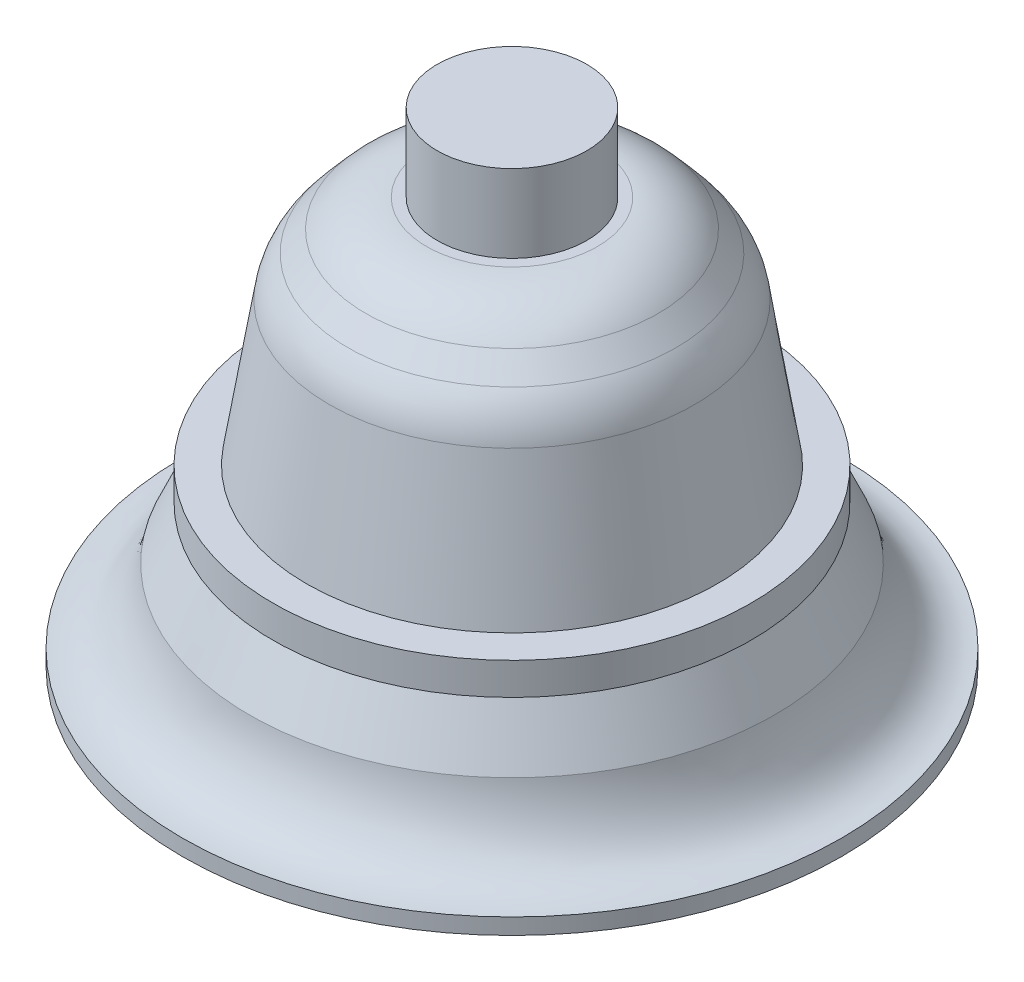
ISO-10303-21;
HEADER;
FILE_DESCRIPTION(('STEP AP214'),'2;1');
FILE_NAME('part.step','',(''),(''),'','','');
FILE_SCHEMA(('AUTOMOTIVE_DESIGN { 1 0 10303 214 1 1 1 1 }'));
ENDSEC;
DATA;
#1=APPLICATION_CONTEXT('core data for automotive mechanical design processes');
#2=APPLICATION_PROTOCOL_DEFINITION('international standard','automotive_design',2000,#1);
#3=PRODUCT_CONTEXT('',#1,'mechanical');
#4=PRODUCT('Part','Part','',(#3));
#5=PRODUCT_RELATED_PRODUCT_CATEGORY('part','',(#4));
#6=PRODUCT_DEFINITION_FORMATION('','',#4);
#7=PRODUCT_DEFINITION_CONTEXT('part definition',#1,'design');
#8=PRODUCT_DEFINITION('design','',#6,#7);
#9=PRODUCT_DEFINITION_SHAPE('','',#8);
#10=(LENGTH_UNIT() NAMED_UNIT(*) SI_UNIT(.MILLI.,.METRE.));
#11=(NAMED_UNIT(*) PLANE_ANGLE_UNIT() SI_UNIT($,.RADIAN.));
#12=(NAMED_UNIT(*) SI_UNIT($,.STERADIAN.) SOLID_ANGLE_UNIT());
#13=UNCERTAINTY_MEASURE_WITH_UNIT(LENGTH_MEASURE(1.E-05),#10,'distance_accuracy_value','');
#14=(GEOMETRIC_REPRESENTATION_CONTEXT(3) GLOBAL_UNCERTAINTY_ASSIGNED_CONTEXT((#13)) GLOBAL_UNIT_ASSIGNED_CONTEXT((#10,
#11,#12)) REPRESENTATION_CONTEXT('',''));
#15=CARTESIAN_POINT('',(0.,0.,0.));
#16=DIRECTION('',(0.,0.,1.));
#17=DIRECTION('',(1.,0.,0.));
#18=AXIS2_PLACEMENT_3D('',#15,#16,#17);
#19=CARTESIAN_POINT('',(0.,10.5147102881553,-30.733664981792));
#20=CARTESIAN_POINT('',(0.,9.09646290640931,-30.9523627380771));
#21=CARTESIAN_POINT('',(0.,6.25695318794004,-31.7179297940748));
#22=CARTESIAN_POINT('',(0.,3.24208382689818,-33.4625573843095));
#23=CARTESIAN_POINT('',(0.,1.44275660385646,-35.3297078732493));
#24=CARTESIAN_POINT('',(0.,0.443371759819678,-36.9732924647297));
#25=CARTESIAN_POINT('',(0.,-0.0644643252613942,-38.5409114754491));
#26=CARTESIAN_POINT('',(0.,-0.27110225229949,-39.9312003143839));
#27=CARTESIAN_POINT('',(0.,-0.30480306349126,-40.681149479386));
#28=CARTESIAN_POINT('',(0.,-0.30480306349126,-41.0498640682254));
#29=B_SPLINE_CURVE_WITH_KNOTS('',3,(#19,#20,#21,#22,#23,#24,#25,#26,#27,#28),.UNSPECIFIED.,.F.,
.F.,(4,1,1,1,1,1,1,4),(0.,0.25,0.5,0.625,0.75,0.875,0.9375,1.),.UNSPECIFIED.);
#30=CARTESIAN_POINT('',(0.,10.8195133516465,0.));
#31=DIRECTION('',(0.,-1.,0.));
#32=AXIS1_PLACEMENT('',#30,#31);
#33=SURFACE_OF_REVOLUTION('',#29,#32);
#34=CARTESIAN_POINT('',(0.,-0.30480306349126,0.));
#35=DIRECTION('',(0.,-1.,0.));
#36=DIRECTION('',(0.,0.,-1.));
#37=AXIS2_PLACEMENT_3D('',#34,#35,#36);
#38=CIRCLE('',#37,41.0498640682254);
#39=CARTESIAN_POINT('',(0.,-0.30480306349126,-41.0498640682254));
#40=VERTEX_POINT('',#39);
#41=EDGE_CURVE('E10',#40,#40,#38,.T.);
#42=ORIENTED_EDGE('',*,*,#41,.T.);
#43=EDGE_LOOP('',(#42));
#44=FACE_BOUND('',#43,.T.);
#45=CARTESIAN_POINT('',(0.,10.5147102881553,0.));
#46=DIRECTION('',(0.,-1.,0.));
#47=DIRECTION('',(0.,0.,-1.));
#48=AXIS2_PLACEMENT_3D('',#45,#46,#47);
#49=CIRCLE('',#48,30.733664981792);
#50=CARTESIAN_POINT('',(0.,10.5147102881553,-30.733664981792));
#51=VERTEX_POINT('',#50);
#52=EDGE_CURVE('E84',#51,#51,#49,.T.);
#53=ORIENTED_EDGE('',*,*,#52,.F.);
#54=EDGE_LOOP('',(#53));
#55=FACE_BOUND('',#54,.T.);
#56=ADVANCED_FACE('F36',(#44,#55),#33,.F.);
#57=CARTESIAN_POINT('',(0.,10.8195133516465,0.));
#58=DIRECTION('',(0.,-1.,0.));
#59=DIRECTION('',(0.,0.,-1.));
#60=AXIS2_PLACEMENT_3D('',#57,#58,#59);
#61=CYLINDRICAL_SURFACE('',#60,41.0498640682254);
#62=CARTESIAN_POINT('',(0.,1.69519693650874,0.));
#63=DIRECTION('',(0.,-1.,0.));
#64=DIRECTION('',(0.,0.,-1.));
#65=AXIS2_PLACEMENT_3D('',#62,#63,#64);
#66=CIRCLE('',#65,41.0498640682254);
#67=CARTESIAN_POINT('',(0.,1.69519693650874,-41.0498640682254));
#68=VERTEX_POINT('',#67);
#69=EDGE_CURVE('E44',#68,#68,#66,.T.);
#70=ORIENTED_EDGE('',*,*,#69,.T.);
#71=EDGE_LOOP('',(#70));
#72=FACE_BOUND('',#71,.T.);
#73=ORIENTED_EDGE('',*,*,#41,.F.);
#74=EDGE_LOOP('',(#73));
#75=FACE_BOUND('',#74,.T.);
#76=ADVANCED_FACE('F103',(#72,#75),#61,.T.);
#77=CARTESIAN_POINT('',(0.,1.69519693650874,-41.0498640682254));
#78=CARTESIAN_POINT('',(0.,1.69519693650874,-40.7438213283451));
#79=CARTESIAN_POINT('',(0.,1.72402123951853,-40.1122573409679));
#80=CARTESIAN_POINT('',(0.,1.88921846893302,-39.0127451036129));
#81=CARTESIAN_POINT('',(0.,2.28139088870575,-37.807256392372));
#82=CARTESIAN_POINT('',(0.,3.03360538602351,-36.5703123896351));
#83=CARTESIAN_POINT('',(0.,4.43959818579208,-35.10049370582));
#84=CARTESIAN_POINT('',(0.,6.89085856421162,-33.6587637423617));
#85=CARTESIAN_POINT('',(0.,9.35415681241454,-32.9608292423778));
#86=CARTESIAN_POINT('',(0.,10.616498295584,-32.7425017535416));
#87=CARTESIAN_POINT('',(0.,10.7431650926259,-32.7220754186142));
#88=CARTESIAN_POINT('',(0.,10.8195133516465,-32.7103023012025));
#89=B_SPLINE_CURVE_WITH_KNOTS('',3,(#77,#78,#79,#80,#81,#82,#83,#84,#85,#86,#87,#88),
.UNSPECIFIED.,.F.,.F.,(4,1,1,1,1,1,1,1,1,4),(0.,0.0625,0.125,0.25,0.375,0.5,0.75,
0.974804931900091,0.984882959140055,1.),.UNSPECIFIED.);
#90=CARTESIAN_POINT('',(0.,10.8195133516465,0.));
#91=DIRECTION('',(0.,-1.,0.));
#92=AXIS1_PLACEMENT('',#90,#91);
#93=SURFACE_OF_REVOLUTION('',#89,#92);
#94=CARTESIAN_POINT('',(0.,10.8195133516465,0.));
#95=DIRECTION('',(0.,-1.,0.));
#96=DIRECTION('',(0.,0.,-1.));
#97=AXIS2_PLACEMENT_3D('',#94,#95,#96);
#98=CIRCLE('',#97,32.7103023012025);
#99=CARTESIAN_POINT('',(0.,10.8195133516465,-32.7103023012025));
#100=VERTEX_POINT('',#99);
#101=EDGE_CURVE('E48',#100,#100,#98,.T.);
#102=ORIENTED_EDGE('',*,*,#101,.T.);
#103=EDGE_LOOP('',(#102));
#104=FACE_BOUND('',#103,.T.);
#105=ORIENTED_EDGE('',*,*,#69,.F.);
#106=EDGE_LOOP('',(#105));
#107=FACE_BOUND('',#106,.T.);
#108=ADVANCED_FACE('F99',(#104,#107),#93,.F.);
#109=CARTESIAN_POINT('',(0.,10.8195133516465,0.));
#110=DIRECTION('',(0.,-1.,0.));
#111=DIRECTION('',(0.,0.,-1.));
#112=AXIS2_PLACEMENT_3D('',#109,#110,#111);
#113=CONICAL_SURFACE('',#112,32.7103023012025,0.418914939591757);
#114=CARTESIAN_POINT('',(0.,17.4051870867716,0.));
#115=DIRECTION('',(0.,-1.,0.));
#116=DIRECTION('',(0.,0.,-1.));
#117=AXIS2_PLACEMENT_3D('',#114,#115,#116);
#118=CIRCLE('',#117,29.7778879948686);
#119=CARTESIAN_POINT('',(0.,17.4051870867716,-29.7778879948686));
#120=VERTEX_POINT('',#119);
#121=EDGE_CURVE('E52',#120,#120,#118,.T.);
#122=ORIENTED_EDGE('',*,*,#121,.T.);
#123=EDGE_LOOP('',(#122));
#124=FACE_BOUND('',#123,.T.);
#125=ORIENTED_EDGE('',*,*,#101,.F.);
#126=EDGE_LOOP('',(#125));
#127=FACE_BOUND('',#126,.T.);
#128=ADVANCED_FACE('F102',(#124,#127),#113,.T.);
#129=CARTESIAN_POINT('',(0.,10.8195133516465,0.));
#130=DIRECTION('',(0.,-1.,0.));
#131=DIRECTION('',(0.,0.,-1.));
#132=AXIS2_PLACEMENT_3D('',#129,#130,#131);
#133=CYLINDRICAL_SURFACE('',#132,29.7778879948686);
#134=CARTESIAN_POINT('',(0.,21.4107168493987,0.));
#135=DIRECTION('',(0.,-1.,0.));
#136=DIRECTION('',(0.,0.,-1.));
#137=AXIS2_PLACEMENT_3D('',#134,#135,#136);
#138=CIRCLE('',#137,29.7778879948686);
#139=CARTESIAN_POINT('',(0.,21.4107168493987,-29.7778879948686));
#140=VERTEX_POINT('',#139);
#141=EDGE_CURVE('E57',#140,#140,#138,.T.);
#142=ORIENTED_EDGE('',*,*,#141,.T.);
#143=EDGE_LOOP('',(#142));
#144=FACE_BOUND('',#143,.T.);
#145=ORIENTED_EDGE('',*,*,#121,.F.);
#146=EDGE_LOOP('',(#145));
#147=FACE_BOUND('',#146,.T.);
#148=ADVANCED_FACE('F162',(#144,#147),#133,.T.);
#149=CARTESIAN_POINT('',(0.,21.4107168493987,-29.7778879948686));
#150=DIRECTION('',(0.,1.,0.));
#151=DIRECTION('',(0.,0.,1.));
#152=AXIS2_PLACEMENT_3D('',#149,#150,#151);
#153=PLANE('',#152);
#154=CARTESIAN_POINT('',(0.,21.4107168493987,0.));
#155=DIRECTION('',(0.,-1.,0.));
#156=DIRECTION('',(0.,0.,-1.));
#157=AXIS2_PLACEMENT_3D('',#154,#155,#156);
#158=CIRCLE('',#157,25.5990358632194);
#159=CARTESIAN_POINT('',(0.,21.4107168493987,-25.5990358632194));
#160=VERTEX_POINT('',#159);
#161=EDGE_CURVE('E60',#160,#160,#158,.T.);
#162=ORIENTED_EDGE('',*,*,#161,.T.);
#163=EDGE_LOOP('',(#162));
#164=FACE_BOUND('',#163,.T.);
#165=ORIENTED_EDGE('',*,*,#141,.F.);
#166=EDGE_LOOP('',(#165));
#167=FACE_BOUND('',#166,.T.);
#168=ADVANCED_FACE('F159',(#164,#167),#153,.T.);
#169=CARTESIAN_POINT('',(0.,21.4107168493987,0.));
#170=DIRECTION('',(0.,-1.,0.));
#171=DIRECTION('',(0.,0.,-1.));
#172=AXIS2_PLACEMENT_3D('',#169,#170,#171);
#173=CONICAL_SURFACE('',#172,25.5990358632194,0.158087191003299);
#174=CARTESIAN_POINT('',(0.,39.3116585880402,0.));
#175=DIRECTION('',(0.,-1.,0.));
#176=DIRECTION('',(0.,0.,-1.));
#177=AXIS2_PLACEMENT_3D('',#174,#175,#176);
#178=CIRCLE('',#177,22.7453135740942);
#179=CARTESIAN_POINT('',(0.,39.3116585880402,-22.7453135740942));
#180=VERTEX_POINT('',#179);
#181=EDGE_CURVE('E63',#180,#180,#178,.T.);
#182=ORIENTED_EDGE('',*,*,#181,.T.);
#183=EDGE_LOOP('',(#182));
#184=FACE_BOUND('',#183,.T.);
#185=ORIENTED_EDGE('',*,*,#161,.F.);
#186=EDGE_LOOP('',(#185));
#187=FACE_BOUND('',#186,.T.);
#188=ADVANCED_FACE('F155',(#184,#187),#173,.T.);
#189=CARTESIAN_POINT('',(0.,37.7373631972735,0.));
#190=DIRECTION('',(0.,-1.,0.));
#191=DIRECTION('',(0.,0.,-1.));
#192=AXIS2_PLACEMENT_3D('',#189,#190,#191);
#193=TOROIDAL_SURFACE('',#192,12.870011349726,10.);
#194=CARTESIAN_POINT('',(0.,44.2866685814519,0.));
#195=DIRECTION('',(0.,-1.,0.));
#196=DIRECTION('',(0.,0.,-1.));
#197=AXIS2_PLACEMENT_3D('',#194,#195,#196);
#198=CIRCLE('',#197,20.4269021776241);
#199=CARTESIAN_POINT('',(0.,44.2866685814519,-20.4269021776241));
#200=VERTEX_POINT('',#199);
#201=EDGE_CURVE('E66',#200,#200,#198,.T.);
#202=ORIENTED_EDGE('',*,*,#201,.T.);
#203=EDGE_LOOP('',(#202));
#204=FACE_BOUND('',#203,.T.);
#205=ORIENTED_EDGE('',*,*,#181,.F.);
#206=EDGE_LOOP('',(#205));
#207=FACE_BOUND('',#206,.T.);
#208=ADVANCED_FACE('F151',(#204,#207),#193,.T.);
#209=CARTESIAN_POINT('',(0.,44.2866685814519,0.));
#210=DIRECTION('',(0.,-1.,0.));
#211=DIRECTION('',(0.,0.,-1.));
#212=AXIS2_PLACEMENT_3D('',#209,#210,#211);
#213=CONICAL_SURFACE('',#212,20.4269021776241,0.714090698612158);
#214=CARTESIAN_POINT('',(0.,46.8606403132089,0.));
#215=DIRECTION('',(0.,-1.,0.));
#216=DIRECTION('',(0.,0.,-1.));
#217=AXIS2_PLACEMENT_3D('',#214,#215,#216);
#218=CIRCLE('',#217,18.1961266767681);
#219=CARTESIAN_POINT('',(0.,46.8606403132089,-18.1961266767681));
#220=VERTEX_POINT('',#219);
#221=EDGE_CURVE('E69',#220,#220,#218,.T.);
#222=ORIENTED_EDGE('',*,*,#221,.T.);
#223=EDGE_LOOP('',(#222));
#224=FACE_BOUND('',#223,.T.);
#225=ORIENTED_EDGE('',*,*,#201,.F.);
#226=EDGE_LOOP('',(#225));
#227=FACE_BOUND('',#226,.T.);
#228=ADVANCED_FACE('F147',(#224,#227),#213,.T.);
#229=CARTESIAN_POINT('',(0.,40.3113349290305,0.));
#230=DIRECTION('',(0.,-1.,0.));
#231=DIRECTION('',(0.,0.,-1.));
#232=AXIS2_PLACEMENT_3D('',#229,#230,#231);
#233=TOROIDAL_SURFACE('',#232,10.6392358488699,10.);
#234=CARTESIAN_POINT('',(0.,50.3113349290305,0.));
#235=DIRECTION('',(0.,-1.,0.));
#236=DIRECTION('',(0.,0.,-1.));
#237=AXIS2_PLACEMENT_3D('',#234,#235,#236);
#238=CIRCLE('',#237,10.6392358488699);
#239=CARTESIAN_POINT('',(0.,50.3113349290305,-10.6392358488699));
#240=VERTEX_POINT('',#239);
#241=EDGE_CURVE('E72',#240,#240,#238,.T.);
#242=ORIENTED_EDGE('',*,*,#241,.T.);
#243=EDGE_LOOP('',(#242));
#244=FACE_BOUND('',#243,.T.);
#245=ORIENTED_EDGE('',*,*,#221,.F.);
#246=EDGE_LOOP('',(#245));
#247=FACE_BOUND('',#246,.T.);
#248=ADVANCED_FACE('F143',(#244,#247),#233,.T.);
#249=CARTESIAN_POINT('',(0.,50.3113349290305,-10.6392358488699));
#250=DIRECTION('',(0.,1.,0.));
#251=DIRECTION('',(0.,0.,1.));
#252=AXIS2_PLACEMENT_3D('',#249,#250,#251);
#253=PLANE('',#252);
#254=CARTESIAN_POINT('',(0.,50.3113349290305,0.));
#255=DIRECTION('',(0.,-1.,0.));
#256=DIRECTION('',(0.,0.,-1.));
#257=AXIS2_PLACEMENT_3D('',#254,#255,#256);
#258=CIRCLE('',#257,9.32485054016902);
#259=CARTESIAN_POINT('',(0.,50.3113349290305,-9.32485054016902));
#260=VERTEX_POINT('',#259);
#261=EDGE_CURVE('E75',#260,#260,#258,.T.);
#262=ORIENTED_EDGE('',*,*,#261,.T.);
#263=EDGE_LOOP('',(#262));
#264=FACE_BOUND('',#263,.T.);
#265=ORIENTED_EDGE('',*,*,#241,.F.);
#266=EDGE_LOOP('',(#265));
#267=FACE_BOUND('',#266,.T.);
#268=ADVANCED_FACE('F139',(#264,#267),#253,.T.);
#269=CARTESIAN_POINT('',(0.,10.8195133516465,0.));
#270=DIRECTION('',(0.,-1.,0.));
#271=DIRECTION('',(0.,0.,-1.));
#272=AXIS2_PLACEMENT_3D('',#269,#270,#271);
#273=CYLINDRICAL_SURFACE('',#272,9.32485054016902);
#274=CARTESIAN_POINT('',(0.,60.,0.));
#275=DIRECTION('',(0.,-1.,0.));
#276=DIRECTION('',(0.,0.,-1.));
#277=AXIS2_PLACEMENT_3D('',#274,#275,#276);
#278=CIRCLE('',#277,9.32485054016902);
#279=CARTESIAN_POINT('',(0.,60.,-9.32485054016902));
#280=VERTEX_POINT('',#279);
#281=EDGE_CURVE('E78',#280,#280,#278,.T.);
#282=ORIENTED_EDGE('',*,*,#281,.T.);
#283=EDGE_LOOP('',(#282));
#284=FACE_BOUND('',#283,.T.);
#285=ORIENTED_EDGE('',*,*,#261,.F.);
#286=EDGE_LOOP('',(#285));
#287=FACE_BOUND('',#286,.T.);
#288=ADVANCED_FACE('F131',(#284,#287),#273,.T.);
#289=CARTESIAN_POINT('',(0.,60.,0.));
#290=DIRECTION('',(0.,1.,0.));
#291=DIRECTION('',(0.,0.,1.));
#292=AXIS2_PLACEMENT_3D('',#289,#290,#291);
#293=PLANE('',#292);
#294=ORIENTED_EDGE('',*,*,#281,.F.);
#295=EDGE_LOOP('',(#294));
#296=FACE_BOUND('',#295,.T.);
#297=ADVANCED_FACE('F125',(#296),#293,.T.);
#298=CARTESIAN_POINT('',(0.,10.8195133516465,-30.679241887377));
#299=DIRECTION('',(0.,-1.,0.));
#300=DIRECTION('',(0.,0.,-1.));
#301=AXIS2_PLACEMENT_3D('',#298,#299,#300);
#302=PLANE('',#301);
#303=CARTESIAN_POINT('',(0.,10.8195133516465,0.));
#304=DIRECTION('',(0.,-1.,0.));
#305=DIRECTION('',(0.,0.,-1.));
#306=AXIS2_PLACEMENT_3D('',#303,#304,#305);
#307=CIRCLE('',#306,30.5209947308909);
#308=CARTESIAN_POINT('',(0.,10.8195133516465,-30.5209947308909));
#309=VERTEX_POINT('',#308);
#310=EDGE_CURVE('E87',#309,#309,#307,.F.);
#311=ORIENTED_EDGE('',*,*,#310,.T.);
#312=EDGE_LOOP('',(#311));
#313=FACE_BOUND('',#312,.T.);
#314=CARTESIAN_POINT('',(0.,10.8195133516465,0.));
#315=DIRECTION('',(0.,-1.,0.));
#316=DIRECTION('',(0.,0.,-1.));
#317=AXIS2_PLACEMENT_3D('',#314,#315,#316);
#318=CIRCLE('',#317,30.679241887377);
#319=CARTESIAN_POINT('',(0.,10.8195133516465,-30.679241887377));
#320=VERTEX_POINT('',#319);
#321=EDGE_CURVE('E81',#320,#320,#318,.T.);
#322=ORIENTED_EDGE('',*,*,#321,.T.);
#323=EDGE_LOOP('',(#322));
#324=FACE_BOUND('',#323,.T.);
#325=ADVANCED_FACE('F120',(#313,#324),#302,.T.);
#326=CARTESIAN_POINT('',(0.,10.8195133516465,0.));
#327=DIRECTION('',(0.,-1.,0.));
#328=DIRECTION('',(0.,0.,-1.));
#329=AXIS2_PLACEMENT_3D('',#326,#327,#328);
#330=CONICAL_SURFACE('',#329,30.679241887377,0.176689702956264);
#331=ORIENTED_EDGE('',*,*,#52,.T.);
#332=EDGE_LOOP('',(#331));
#333=FACE_BOUND('',#332,.T.);
#334=ORIENTED_EDGE('',*,*,#321,.F.);
#335=EDGE_LOOP('',(#334));
#336=FACE_BOUND('',#335,.T.);
#337=ADVANCED_FACE('F116',(#333,#336),#330,.F.);
#338=CARTESIAN_POINT('',(0.,10.0059744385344,0.));
#339=DIRECTION('',(0.,-1.,0.));
#340=DIRECTION('',(0.,0.,-1.));
#341=AXIS2_PLACEMENT_3D('',#338,#339,#340);
#342=CONICAL_SURFACE('',#341,30.8832406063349,0.418914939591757);
#343=CARTESIAN_POINT('',(0.,16.9800364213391,0.));
#344=DIRECTION('',(0.,-1.,0.));
#345=DIRECTION('',(0.,0.,-1.));
#346=AXIS2_PLACEMENT_3D('',#343,#344,#345);
#347=CIRCLE('',#346,27.7778879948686);
#348=CARTESIAN_POINT('',(0.,16.9800364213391,-27.7778879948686));
#349=VERTEX_POINT('',#348);
#350=EDGE_CURVE('E373',#349,#349,#347,.T.);
#351=ORIENTED_EDGE('',*,*,#350,.F.);
#352=EDGE_LOOP('',(#351));
#353=FACE_BOUND('',#352,.T.);
#354=ORIENTED_EDGE('',*,*,#310,.F.);
#355=EDGE_LOOP('',(#354));
#356=FACE_BOUND('',#355,.T.);
#357=ADVANCED_FACE('F119',(#353,#356),#342,.F.);
#358=CARTESIAN_POINT('',(0.,10.8195133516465,0.));
#359=DIRECTION('',(0.,-1.,0.));
#360=DIRECTION('',(0.,0.,-1.));
#361=AXIS2_PLACEMENT_3D('',#358,#359,#360);
#362=CYLINDRICAL_SURFACE('',#361,27.7778879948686);
#363=CARTESIAN_POINT('',(0.,18.4107168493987,0.));
#364=DIRECTION('',(0.,-1.,0.));
#365=DIRECTION('',(0.,0.,-1.));
#366=AXIS2_PLACEMENT_3D('',#363,#364,#365);
#367=CIRCLE('',#366,27.7778879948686);
#368=CARTESIAN_POINT('',(0.,18.4107168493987,-27.7778879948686));
#369=VERTEX_POINT('',#368);
#370=EDGE_CURVE('E365',#369,#369,#367,.T.);
#371=ORIENTED_EDGE('',*,*,#370,.F.);
#372=EDGE_LOOP('',(#371));
#373=FACE_BOUND('',#372,.T.);
#374=ORIENTED_EDGE('',*,*,#350,.T.);
#375=EDGE_LOOP('',(#374));
#376=FACE_BOUND('',#375,.T.);
#377=ADVANCED_FACE('F256',(#373,#376),#362,.F.);
#378=CARTESIAN_POINT('',(0.,18.4107168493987,0.));
#379=DIRECTION('',(0.,-1.,0.));
#380=DIRECTION('',(0.,0.,-1.));
#381=AXIS2_PLACEMENT_3D('',#378,#379,#380);
#382=PLANE('',#381);
#383=ORIENTED_EDGE('',*,*,#370,.T.);
#384=EDGE_LOOP('',(#383));
#385=FACE_BOUND('',#384,.T.);
#386=ADVANCED_FACE('F266',(#385),#382,.T.);
#387=CLOSED_SHELL('',(#56,#76,#108,#128,#148,#168,#188,#208,#228,#248,#268,#288,#297,#325,#337,
#357,#377,#386));
#388=CARTESIAN_POINT('',(0.,58.,0.));
#389=DIRECTION('',(0.,1.,0.));
#390=DIRECTION('',(0.,0.,1.));
#391=AXIS2_PLACEMENT_3D('',#388,#389,#390);
#392=PLANE('',#391);
#393=CARTESIAN_POINT('',(0.,58.,0.));
#394=DIRECTION('',(0.,1.,0.));
#395=DIRECTION('',(0.,0.,1.));
#396=AXIS2_PLACEMENT_3D('',#393,#394,#395);
#397=CIRCLE('',#396,7.32485054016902);
#398=CARTESIAN_POINT('',(0.,58.,7.32485054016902));
#399=VERTEX_POINT('',#398);
#400=EDGE_CURVE('E364',#399,#399,#397,.F.);
#401=ORIENTED_EDGE('',*,*,#400,.T.);
#402=EDGE_LOOP('',(#401));
#403=FACE_BOUND('',#402,.T.);
#404=ADVANCED_FACE('F324',(#403),#392,.F.);
#405=CARTESIAN_POINT('',(0.,10.8195133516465,0.));
#406=DIRECTION('',(0.,-1.,0.));
#407=DIRECTION('',(0.,0.,-1.));
#408=AXIS2_PLACEMENT_3D('',#405,#406,#407);
#409=CYLINDRICAL_SURFACE('',#408,7.32485054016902);
#410=ORIENTED_EDGE('',*,*,#400,.F.);
#411=EDGE_LOOP('',(#410));
#412=FACE_BOUND('',#411,.T.);
#413=CARTESIAN_POINT('',(0.,48.3113349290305,0.));
#414=DIRECTION('',(0.,1.,0.));
#415=DIRECTION('',(0.,0.,1.));
#416=AXIS2_PLACEMENT_3D('',#413,#414,#415);
#417=CIRCLE('',#416,7.32485054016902);
#418=CARTESIAN_POINT('',(0.,48.3113349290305,7.32485054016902));
#419=VERTEX_POINT('',#418);
#420=EDGE_CURVE('E368',#419,#419,#417,.F.);
#421=ORIENTED_EDGE('',*,*,#420,.T.);
#422=EDGE_LOOP('',(#421));
#423=FACE_BOUND('',#422,.T.);
#424=ADVANCED_FACE('F315',(#412,#423),#409,.F.);
#425=CARTESIAN_POINT('',(0.,48.3113349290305,-10.6392358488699));
#426=DIRECTION('',(0.,1.,0.));
#427=DIRECTION('',(0.,0.,1.));
#428=AXIS2_PLACEMENT_3D('',#425,#426,#427);
#429=PLANE('',#428);
#430=ORIENTED_EDGE('',*,*,#420,.F.);
#431=EDGE_LOOP('',(#430));
#432=FACE_BOUND('',#431,.T.);
#433=CARTESIAN_POINT('',(0.,48.3113349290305,0.));
#434=DIRECTION('',(0.,-1.,0.));
#435=DIRECTION('',(0.,0.,-1.));
#436=AXIS2_PLACEMENT_3D('',#433,#434,#435);
#437=CIRCLE('',#436,10.6392358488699);
#438=CARTESIAN_POINT('',(0.,48.3113349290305,-10.6392358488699));
#439=VERTEX_POINT('',#438);
#440=EDGE_CURVE('E385',#439,#439,#437,.T.);
#441=ORIENTED_EDGE('',*,*,#440,.T.);
#442=EDGE_LOOP('',(#441));
#443=FACE_BOUND('',#442,.T.);
#444=ADVANCED_FACE('F306',(#432,#443),#429,.F.);
#445=CARTESIAN_POINT('',(0.,40.3113349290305,0.));
#446=DIRECTION('',(0.,-1.,0.));
#447=DIRECTION('',(0.,0.,-1.));
#448=AXIS2_PLACEMENT_3D('',#445,#446,#447);
#449=TOROIDAL_SURFACE('',#448,10.6392358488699,8.);
#450=ORIENTED_EDGE('',*,*,#440,.F.);
#451=EDGE_LOOP('',(#450));
#452=FACE_BOUND('',#451,.T.);
#453=CARTESIAN_POINT('',(0.,45.5507792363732,0.));
#454=DIRECTION('',(0.,-1.,0.));
#455=DIRECTION('',(0.,0.,-1.));
#456=AXIS2_PLACEMENT_3D('',#453,#454,#455);
#457=CIRCLE('',#456,16.6847485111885);
#458=CARTESIAN_POINT('',(0.,45.5507792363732,-16.6847485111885));
#459=VERTEX_POINT('',#458);
#460=EDGE_CURVE('E382',#459,#459,#457,.T.);
#461=ORIENTED_EDGE('',*,*,#460,.T.);
#462=EDGE_LOOP('',(#461));
#463=FACE_BOUND('',#462,.T.);
#464=ADVANCED_FACE('F297',(#452,#463),#449,.F.);
#465=CARTESIAN_POINT('',(0.,42.9768075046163,0.));
#466=DIRECTION('',(0.,-1.,0.));
#467=DIRECTION('',(0.,0.,-1.));
#468=AXIS2_PLACEMENT_3D('',#465,#466,#467);
#469=CONICAL_SURFACE('',#468,18.9155240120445,0.714090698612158);
#470=ORIENTED_EDGE('',*,*,#460,.F.);
#471=EDGE_LOOP('',(#470));
#472=FACE_BOUND('',#471,.T.);
#473=CARTESIAN_POINT('',(0.,42.9768075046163,0.));
#474=DIRECTION('',(0.,-1.,0.));
#475=DIRECTION('',(0.,0.,-1.));
#476=AXIS2_PLACEMENT_3D('',#473,#474,#475);
#477=CIRCLE('',#476,18.9155240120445);
#478=CARTESIAN_POINT('',(0.,42.9768075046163,-18.9155240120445));
#479=VERTEX_POINT('',#478);
#480=EDGE_CURVE('E379',#479,#479,#477,.T.);
#481=ORIENTED_EDGE('',*,*,#480,.T.);
#482=EDGE_LOOP('',(#481));
#483=FACE_BOUND('',#482,.T.);
#484=ADVANCED_FACE('F288',(#472,#483),#469,.F.);
#485=CARTESIAN_POINT('',(0.,37.7373631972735,0.));
#486=DIRECTION('',(0.,-1.,0.));
#487=DIRECTION('',(0.,0.,-1.));
#488=AXIS2_PLACEMENT_3D('',#485,#486,#487);
#489=TOROIDAL_SURFACE('',#488,12.870011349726,8.);
#490=ORIENTED_EDGE('',*,*,#480,.F.);
#491=EDGE_LOOP('',(#490));
#492=FACE_BOUND('',#491,.T.);
#493=CARTESIAN_POINT('',(0.,38.9967995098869,0.));
#494=DIRECTION('',(0.,-1.,0.));
#495=DIRECTION('',(0.,0.,-1.));
#496=AXIS2_PLACEMENT_3D('',#493,#494,#495);
#497=CIRCLE('',#496,20.7702531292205);
#498=CARTESIAN_POINT('',(0.,38.9967995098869,-20.7702531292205));
#499=VERTEX_POINT('',#498);
#500=EDGE_CURVE('E376',#499,#499,#497,.T.);
#501=ORIENTED_EDGE('',*,*,#500,.T.);
#502=EDGE_LOOP('',(#501));
#503=FACE_BOUND('',#502,.T.);
#504=ADVANCED_FACE('F278',(#492,#503),#489,.F.);
#505=CARTESIAN_POINT('',(0.,21.0958577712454,0.));
#506=DIRECTION('',(0.,-1.,0.));
#507=DIRECTION('',(0.,0.,-1.));
#508=AXIS2_PLACEMENT_3D('',#505,#506,#507);
#509=CONICAL_SURFACE('',#508,23.6239754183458,0.158087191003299);
#510=ORIENTED_EDGE('',*,*,#500,.F.);
#511=EDGE_LOOP('',(#510));
#512=FACE_BOUND('',#511,.T.);
#513=CARTESIAN_POINT('',(0.,19.4107168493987,0.));
#514=DIRECTION('',(0.,-1.,0.));
#515=DIRECTION('',(0.,0.,-1.));
#516=AXIS2_PLACEMENT_3D('',#513,#514,#515);
#517=CIRCLE('',#516,23.8926162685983);
#518=CARTESIAN_POINT('',(0.,19.4107168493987,-23.8926162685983));
#519=VERTEX_POINT('',#518);
#520=EDGE_CURVE('E362',#519,#519,#517,.F.);
#521=ORIENTED_EDGE('',*,*,#520,.F.);
#522=EDGE_LOOP('',(#521));
#523=FACE_BOUND('',#522,.T.);
#524=ADVANCED_FACE('F272',(#512,#523),#509,.F.);
#525=CARTESIAN_POINT('',(0.,19.4107168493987,0.));
#526=DIRECTION('',(0.,-1.,0.));
#527=DIRECTION('',(0.,0.,-1.));
#528=AXIS2_PLACEMENT_3D('',#525,#526,#527);
#529=PLANE('',#528);
#530=ORIENTED_EDGE('',*,*,#520,.T.);
#531=EDGE_LOOP('',(#530));
#532=FACE_BOUND('',#531,.T.);
#533=ADVANCED_FACE('F277',(#532),#529,.F.);
#534=CLOSED_SHELL('',(#404,#424,#444,#464,#484,#504,#524,#533));
#535=ORIENTED_CLOSED_SHELL('',*,#534,.T.);
#536=BREP_WITH_VOIDS('B2',#387,(#535));
#537=ADVANCED_BREP_SHAPE_REPRESENTATION('',(#18,#536),#14);
#538=SHAPE_DEFINITION_REPRESENTATION(#9,#537);
ENDSEC;
END-ISO-10303-21;
